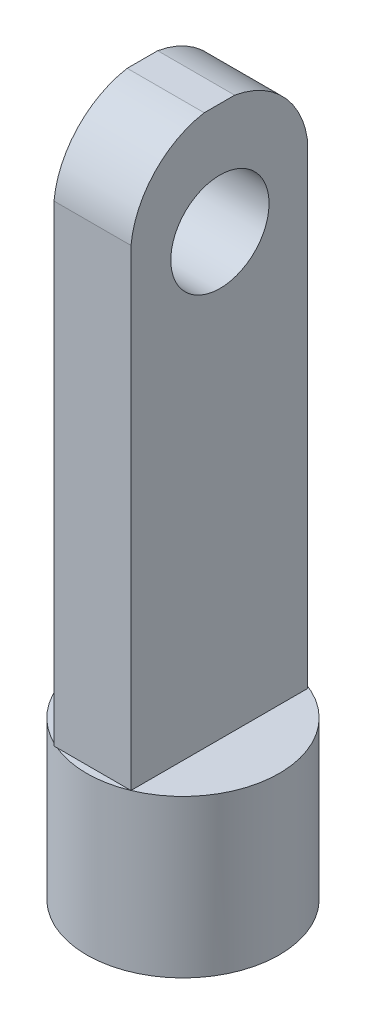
ISO-10303-21;
HEADER;
FILE_DESCRIPTION(('STEP AP214'),'2;1');
FILE_NAME('part.step','',(''),(''),'','','');
FILE_SCHEMA(('AUTOMOTIVE_DESIGN { 1 0 10303 214 1 1 1 1 }'));
ENDSEC;
DATA;
#1=APPLICATION_CONTEXT('core data for automotive mechanical design processes');
#2=APPLICATION_PROTOCOL_DEFINITION('international standard','automotive_design',2000,#1);
#3=PRODUCT_CONTEXT('',#1,'mechanical');
#4=PRODUCT('Part','Part','',(#3));
#5=PRODUCT_RELATED_PRODUCT_CATEGORY('part','',(#4));
#6=PRODUCT_DEFINITION_FORMATION('','',#4);
#7=PRODUCT_DEFINITION_CONTEXT('part definition',#1,'design');
#8=PRODUCT_DEFINITION('design','',#6,#7);
#9=PRODUCT_DEFINITION_SHAPE('','',#8);
#10=(LENGTH_UNIT() NAMED_UNIT(*) SI_UNIT(.MILLI.,.METRE.));
#11=(NAMED_UNIT(*) PLANE_ANGLE_UNIT() SI_UNIT($,.RADIAN.));
#12=(NAMED_UNIT(*) SI_UNIT($,.STERADIAN.) SOLID_ANGLE_UNIT());
#13=UNCERTAINTY_MEASURE_WITH_UNIT(LENGTH_MEASURE(1.E-05),#10,'distance_accuracy_value','');
#14=(GEOMETRIC_REPRESENTATION_CONTEXT(3) GLOBAL_UNCERTAINTY_ASSIGNED_CONTEXT((#13)) GLOBAL_UNIT_ASSIGNED_CONTEXT((#10,
#11,#12)) REPRESENTATION_CONTEXT('',''));
#15=CARTESIAN_POINT('',(0.,0.,0.));
#16=DIRECTION('',(0.,0.,1.));
#17=DIRECTION('',(1.,0.,0.));
#18=AXIS2_PLACEMENT_3D('',#15,#16,#17);
#19=CARTESIAN_POINT('',(-2.58914266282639,45.72,-5.65880457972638));
#20=DIRECTION('',(1.,0.,0.));
#21=DIRECTION('',(0.,0.,-1.));
#22=AXIS2_PLACEMENT_3D('',#19,#20,#21);
#23=PLANE('',#22);
#24=CARTESIAN_POINT('',(-2.58914266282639,40.0566654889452,0.0305906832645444));
#25=DIRECTION('',(-1.,0.,0.));
#26=DIRECTION('',(0.,0.,1.));
#27=AXIS2_PLACEMENT_3D('',#24,#25,#26);
#28=CIRCLE('',#27,5.74821450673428);
#29=CARTESIAN_POINT('',(-2.58914266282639,45.72,-0.953590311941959));
#30=VERTEX_POINT('',#29);
#31=CARTESIAN_POINT('',(-2.58914266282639,40.8768798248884,-5.65880457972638));
#32=VERTEX_POINT('',#31);
#33=EDGE_CURVE('E90',#30,#32,#28,.T.);
#34=ORIENTED_EDGE('',*,*,#33,.T.);
#35=DIRECTION('',(0.,-1.,0.));
#36=VECTOR('',#35,1.);
#37=CARTESIAN_POINT('',(-2.58914266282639,45.72,-5.65880457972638));
#38=LINE('',#37,#36);
#39=CARTESIAN_POINT('',(-2.58914266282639,10.16,-5.65880457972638));
#40=VERTEX_POINT('',#39);
#41=EDGE_CURVE('E112',#32,#40,#38,.T.);
#42=ORIENTED_EDGE('',*,*,#41,.T.);
#43=DIRECTION('',(0.,0.,1.));
#44=VECTOR('',#43,1.);
#45=CARTESIAN_POINT('',(-2.58914266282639,10.16,-5.65880457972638));
#46=LINE('',#45,#44);
#47=CARTESIAN_POINT('',(-2.58914266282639,10.16,5.65880457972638));
#48=VERTEX_POINT('',#47);
#49=EDGE_CURVE('E120',#40,#48,#46,.T.);
#50=ORIENTED_EDGE('',*,*,#49,.T.);
#51=CARTESIAN_POINT('',(-2.58914266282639,10.16,5.74708307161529));
#52=VERTEX_POINT('',#51);
#53=EDGE_CURVE('E124',#48,#52,#46,.T.);
#54=ORIENTED_EDGE('',*,*,#53,.T.);
#55=DIRECTION('',(0.,-1.,0.));
#56=VECTOR('',#55,1.);
#57=CARTESIAN_POINT('',(-2.58914266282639,45.72,5.74708307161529));
#58=LINE('',#57,#56);
#59=CARTESIAN_POINT('',(-2.58914266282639,40.6597283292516,5.74708307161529));
#60=VERTEX_POINT('',#59);
#61=EDGE_CURVE('E135',#60,#52,#58,.T.);
#62=ORIENTED_EDGE('',*,*,#61,.F.);
#63=CARTESIAN_POINT('',(-2.58914266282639,40.0566654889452,0.0305906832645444));
#64=DIRECTION('',(-1.,0.,0.));
#65=DIRECTION('',(0.,0.,1.));
#66=AXIS2_PLACEMENT_3D('',#63,#64,#65);
#67=CIRCLE('',#66,5.74821450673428);
#68=CARTESIAN_POINT('',(-2.58914266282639,45.72,1.01477167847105));
#69=VERTEX_POINT('',#68);
#70=EDGE_CURVE('E109',#60,#69,#67,.T.);
#71=ORIENTED_EDGE('',*,*,#70,.T.);
#72=DIRECTION('',(0.,0.,1.));
#73=VECTOR('',#72,1.);
#74=CARTESIAN_POINT('',(-2.58914266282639,45.72,-5.65880457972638));
#75=LINE('',#74,#73);
#76=EDGE_CURVE('E103',#30,#69,#75,.T.);
#77=ORIENTED_EDGE('',*,*,#76,.F.);
#78=EDGE_LOOP('',(#34,#42,#50,#54,#62,#71,#77));
#79=FACE_BOUND('',#78,.T.);
#80=CARTESIAN_POINT('',(-2.58914266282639,38.5531542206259,0.));
#81=DIRECTION('',(1.,0.,0.));
#82=DIRECTION('',(0.,0.,-1.));
#83=AXIS2_PLACEMENT_3D('',#80,#81,#82);
#84=CIRCLE('',#83,3.175);
#85=CARTESIAN_POINT('',(-2.58914266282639,38.5531542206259,-3.175));
#86=VERTEX_POINT('',#85);
#87=EDGE_CURVE('E36',#86,#86,#84,.F.);
#88=ORIENTED_EDGE('',*,*,#87,.F.);
#89=EDGE_LOOP('',(#88));
#90=FACE_BOUND('',#89,.T.);
#91=ADVANCED_FACE('F32',(#79,#90),#23,.F.);
#92=CARTESIAN_POINT('',(2.38678972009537,45.72,-5.65880457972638));
#93=DIRECTION('',(-1.,0.,0.));
#94=DIRECTION('',(0.,0.,1.));
#95=AXIS2_PLACEMENT_3D('',#92,#93,#94);
#96=PLANE('',#95);
#97=CARTESIAN_POINT('',(2.38678972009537,40.0566654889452,0.0305906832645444));
#98=DIRECTION('',(-1.,0.,0.));
#99=DIRECTION('',(0.,0.,1.));
#100=AXIS2_PLACEMENT_3D('',#97,#98,#99);
#101=CIRCLE('',#100,5.74821450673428);
#102=CARTESIAN_POINT('',(2.38678972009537,45.72,-0.953590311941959));
#103=VERTEX_POINT('',#102);
#104=CARTESIAN_POINT('',(2.38678972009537,40.8768798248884,-5.65880457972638));
#105=VERTEX_POINT('',#104);
#106=EDGE_CURVE('E47',#103,#105,#101,.T.);
#107=ORIENTED_EDGE('',*,*,#106,.F.);
#108=DIRECTION('',(0.,0.,-1.));
#109=VECTOR('',#108,1.);
#110=CARTESIAN_POINT('',(2.38678972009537,45.72,-5.65880457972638));
#111=LINE('',#110,#109);
#112=CARTESIAN_POINT('',(2.38678972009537,45.72,1.01477167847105));
#113=VERTEX_POINT('',#112);
#114=EDGE_CURVE('E105',#113,#103,#111,.T.);
#115=ORIENTED_EDGE('',*,*,#114,.F.);
#116=CARTESIAN_POINT('',(2.38678972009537,40.0566654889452,0.0305906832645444));
#117=DIRECTION('',(-1.,0.,0.));
#118=DIRECTION('',(0.,0.,1.));
#119=AXIS2_PLACEMENT_3D('',#116,#117,#118);
#120=CIRCLE('',#119,5.74821450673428);
#121=CARTESIAN_POINT('',(2.38678972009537,40.6597283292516,5.74708307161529));
#122=VERTEX_POINT('',#121);
#123=EDGE_CURVE('E55',#122,#113,#120,.T.);
#124=ORIENTED_EDGE('',*,*,#123,.F.);
#125=DIRECTION('',(0.,-1.,0.));
#126=VECTOR('',#125,1.);
#127=CARTESIAN_POINT('',(2.38678972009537,45.72,5.74708307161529));
#128=LINE('',#127,#126);
#129=CARTESIAN_POINT('',(2.38678972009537,10.16,5.74708307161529));
#130=VERTEX_POINT('',#129);
#131=EDGE_CURVE('E133',#122,#130,#128,.T.);
#132=ORIENTED_EDGE('',*,*,#131,.T.);
#133=DIRECTION('',(0.,0.,-1.));
#134=VECTOR('',#133,1.);
#135=CARTESIAN_POINT('',(2.38678972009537,10.16,-5.65880457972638));
#136=LINE('',#135,#134);
#137=CARTESIAN_POINT('',(2.38678972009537,10.16,-5.65880457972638));
#138=VERTEX_POINT('',#137);
#139=EDGE_CURVE('E115',#130,#138,#136,.T.);
#140=ORIENTED_EDGE('',*,*,#139,.T.);
#141=DIRECTION('',(0.,-1.,0.));
#142=VECTOR('',#141,1.);
#143=CARTESIAN_POINT('',(2.38678972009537,45.72,-5.65880457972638));
#144=LINE('',#143,#142);
#145=EDGE_CURVE('E131',#105,#138,#144,.T.);
#146=ORIENTED_EDGE('',*,*,#145,.F.);
#147=EDGE_LOOP('',(#107,#115,#124,#132,#140,#146));
#148=FACE_BOUND('',#147,.T.);
#149=CARTESIAN_POINT('',(2.38678972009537,38.5531542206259,0.));
#150=DIRECTION('',(1.,0.,0.));
#151=DIRECTION('',(0.,0.,-1.));
#152=AXIS2_PLACEMENT_3D('',#149,#150,#151);
#153=CIRCLE('',#152,3.175);
#154=CARTESIAN_POINT('',(2.38678972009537,38.5531542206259,-3.175));
#155=VERTEX_POINT('',#154);
#156=EDGE_CURVE('E97',#155,#155,#153,.T.);
#157=ORIENTED_EDGE('',*,*,#156,.F.);
#158=EDGE_LOOP('',(#157));
#159=FACE_BOUND('',#158,.T.);
#160=ADVANCED_FACE('F177',(#148,#159),#96,.F.);
#161=CARTESIAN_POINT('',(0.,45.72,0.));
#162=DIRECTION('',(0.,1.,0.));
#163=DIRECTION('',(0.,0.,1.));
#164=AXIS2_PLACEMENT_3D('',#161,#162,#163);
#165=PLANE('',#164);
#166=ORIENTED_EDGE('',*,*,#114,.T.);
#167=DIRECTION('',(-1.,0.,0.));
#168=VECTOR('',#167,1.);
#169=CARTESIAN_POINT('',(32.9708573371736,45.72,-0.953590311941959));
#170=LINE('',#169,#168);
#171=EDGE_CURVE('E93',#103,#30,#170,.T.);
#172=ORIENTED_EDGE('',*,*,#171,.T.);
#173=ORIENTED_EDGE('',*,*,#76,.T.);
#174=DIRECTION('',(-1.,0.,0.));
#175=VECTOR('',#174,1.);
#176=CARTESIAN_POINT('',(32.9708573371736,45.72,1.01477167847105));
#177=LINE('',#176,#175);
#178=EDGE_CURVE('E41',#69,#113,#177,.F.);
#179=ORIENTED_EDGE('',*,*,#178,.T.);
#180=EDGE_LOOP('',(#166,#172,#173,#179));
#181=FACE_BOUND('',#180,.T.);
#182=ADVANCED_FACE('F102',(#181),#165,.T.);
#183=CARTESIAN_POINT('',(-2.58914266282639,45.72,-5.65880457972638));
#184=DIRECTION('',(0.,0.,1.));
#185=DIRECTION('',(1.,0.,0.));
#186=AXIS2_PLACEMENT_3D('',#183,#184,#185);
#187=PLANE('',#186);
#188=DIRECTION('',(-1.,0.,0.));
#189=VECTOR('',#188,1.);
#190=CARTESIAN_POINT('',(32.9708573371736,40.8768798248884,-5.65880457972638));
#191=LINE('',#190,#189);
#192=EDGE_CURVE('E11',#105,#32,#191,.T.);
#193=ORIENTED_EDGE('',*,*,#192,.F.);
#194=ORIENTED_EDGE('',*,*,#145,.T.);
#195=DIRECTION('',(-1.,0.,0.));
#196=VECTOR('',#195,1.);
#197=CARTESIAN_POINT('',(-2.58914266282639,10.16,-5.65880457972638));
#198=LINE('',#197,#196);
#199=EDGE_CURVE('E110',#138,#40,#198,.T.);
#200=ORIENTED_EDGE('',*,*,#199,.T.);
#201=ORIENTED_EDGE('',*,*,#41,.F.);
#202=EDGE_LOOP('',(#193,#194,#200,#201));
#203=FACE_BOUND('',#202,.T.);
#204=ADVANCED_FACE('F174',(#203),#187,.F.);
#205=CARTESIAN_POINT('',(-2.58914266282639,45.72,5.74708307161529));
#206=DIRECTION('',(0.,0.,-1.));
#207=DIRECTION('',(-1.,0.,0.));
#208=AXIS2_PLACEMENT_3D('',#205,#206,#207);
#209=PLANE('',#208);
#210=DIRECTION('',(-1.,0.,0.));
#211=VECTOR('',#210,1.);
#212=CARTESIAN_POINT('',(32.9708573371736,40.6597283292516,5.74708307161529));
#213=LINE('',#212,#211);
#214=EDGE_CURVE('E179',#122,#60,#213,.T.);
#215=ORIENTED_EDGE('',*,*,#214,.T.);
#216=ORIENTED_EDGE('',*,*,#61,.T.);
#217=DIRECTION('',(1.,0.,0.));
#218=VECTOR('',#217,1.);
#219=CARTESIAN_POINT('',(-2.58914266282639,10.16,5.74708307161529));
#220=LINE('',#219,#218);
#221=CARTESIAN_POINT('',(-2.38678972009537,10.16,5.74708307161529));
#222=VERTEX_POINT('',#221);
#223=EDGE_CURVE('E123',#52,#222,#220,.T.);
#224=ORIENTED_EDGE('',*,*,#223,.T.);
#225=EDGE_CURVE('E127',#222,#130,#220,.T.);
#226=ORIENTED_EDGE('',*,*,#225,.T.);
#227=ORIENTED_EDGE('',*,*,#131,.F.);
#228=EDGE_LOOP('',(#215,#216,#224,#226,#227));
#229=FACE_BOUND('',#228,.T.);
#230=ADVANCED_FACE('F149',(#229),#209,.F.);
#231=CARTESIAN_POINT('',(0.,10.16,0.));
#232=DIRECTION('',(0.,1.,0.));
#233=DIRECTION('',(0.,0.,1.));
#234=AXIS2_PLACEMENT_3D('',#231,#232,#233);
#235=PLANE('',#234);
#236=ORIENTED_EDGE('',*,*,#49,.F.);
#237=CARTESIAN_POINT('',(0.,10.16,0.));
#238=DIRECTION('',(0.,1.,0.));
#239=DIRECTION('',(0.,0.,1.));
#240=AXIS2_PLACEMENT_3D('',#237,#238,#239);
#241=CIRCLE('',#240,6.223);
#242=EDGE_CURVE('E141',#40,#48,#241,.T.);
#243=ORIENTED_EDGE('',*,*,#242,.T.);
#244=EDGE_LOOP('',(#236,#243));
#245=FACE_BOUND('',#244,.T.);
#246=ADVANCED_FACE('F169',(#245),#235,.T.);
#247=ORIENTED_EDGE('',*,*,#199,.F.);
#248=ORIENTED_EDGE('',*,*,#139,.F.);
#249=EDGE_CURVE('E138',#130,#40,#241,.T.);
#250=ORIENTED_EDGE('',*,*,#249,.T.);
#251=EDGE_LOOP('',(#247,#248,#250));
#252=FACE_BOUND('',#251,.T.);
#253=ADVANCED_FACE('F172',(#252),#235,.T.);
#254=CARTESIAN_POINT('',(0.,10.16,0.));
#255=DIRECTION('',(0.,-1.,0.));
#256=DIRECTION('',(0.,0.,-1.));
#257=AXIS2_PLACEMENT_3D('',#254,#255,#256);
#258=CYLINDRICAL_SURFACE('',#257,6.223);
#259=ORIENTED_EDGE('',*,*,#249,.F.);
#260=EDGE_CURVE('E142',#222,#130,#241,.T.);
#261=ORIENTED_EDGE('',*,*,#260,.F.);
#262=EDGE_CURVE('E161',#48,#222,#241,.T.);
#263=ORIENTED_EDGE('',*,*,#262,.F.);
#264=ORIENTED_EDGE('',*,*,#242,.F.);
#265=EDGE_LOOP('',(#259,#261,#263,#264));
#266=FACE_BOUND('',#265,.T.);
#267=CARTESIAN_POINT('',(0.,0.,0.));
#268=DIRECTION('',(0.,1.,0.));
#269=DIRECTION('',(0.,0.,1.));
#270=AXIS2_PLACEMENT_3D('',#267,#268,#269);
#271=CIRCLE('',#270,6.223);
#272=CARTESIAN_POINT('',(0.,0.,6.223));
#273=VERTEX_POINT('',#272);
#274=EDGE_CURVE('E137',#273,#273,#271,.T.);
#275=ORIENTED_EDGE('',*,*,#274,.T.);
#276=EDGE_LOOP('',(#275));
#277=FACE_BOUND('',#276,.T.);
#278=ADVANCED_FACE('F34',(#266,#277),#258,.T.);
#279=ORIENTED_EDGE('',*,*,#225,.F.);
#280=ORIENTED_EDGE('',*,*,#260,.T.);
#281=EDGE_LOOP('',(#279,#280));
#282=FACE_BOUND('',#281,.T.);
#283=ADVANCED_FACE('F154',(#282),#235,.T.);
#284=CARTESIAN_POINT('',(0.,0.,0.));
#285=DIRECTION('',(0.,1.,0.));
#286=DIRECTION('',(0.,0.,1.));
#287=AXIS2_PLACEMENT_3D('',#284,#285,#286);
#288=PLANE('',#287);
#289=ORIENTED_EDGE('',*,*,#274,.F.);
#290=EDGE_LOOP('',(#289));
#291=FACE_BOUND('',#290,.T.);
#292=ADVANCED_FACE('F199',(#291),#288,.F.);
#293=CARTESIAN_POINT('',(0.,10.16,0.));
#294=DIRECTION('',(0.,1.,0.));
#295=DIRECTION('',(0.,0.,1.));
#296=AXIS2_PLACEMENT_3D('',#293,#294,#295);
#297=PLANE('',#296);
#298=ORIENTED_EDGE('',*,*,#53,.F.);
#299=ORIENTED_EDGE('',*,*,#262,.T.);
#300=ORIENTED_EDGE('',*,*,#223,.F.);
#301=EDGE_LOOP('',(#298,#299,#300));
#302=FACE_BOUND('',#301,.T.);
#303=ADVANCED_FACE('F165',(#302),#297,.F.);
#304=CARTESIAN_POINT('',(32.9708573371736,40.0566654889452,0.0305906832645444));
#305=DIRECTION('',(-1.,0.,0.));
#306=DIRECTION('',(0.,0.,1.));
#307=AXIS2_PLACEMENT_3D('',#304,#305,#306);
#308=CYLINDRICAL_SURFACE('',#307,5.74821450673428);
#309=ORIENTED_EDGE('',*,*,#123,.T.);
#310=ORIENTED_EDGE('',*,*,#178,.F.);
#311=ORIENTED_EDGE('',*,*,#70,.F.);
#312=ORIENTED_EDGE('',*,*,#214,.F.);
#313=EDGE_LOOP('',(#309,#310,#311,#312));
#314=FACE_BOUND('',#313,.T.);
#315=ADVANCED_FACE('F205',(#314),#308,.T.);
#316=CARTESIAN_POINT('',(32.9708573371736,40.0566654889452,0.0305906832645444));
#317=DIRECTION('',(-1.,0.,0.));
#318=DIRECTION('',(0.,0.,1.));
#319=AXIS2_PLACEMENT_3D('',#316,#317,#318);
#320=CYLINDRICAL_SURFACE('',#319,5.74821450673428);
#321=ORIENTED_EDGE('',*,*,#106,.T.);
#322=ORIENTED_EDGE('',*,*,#192,.T.);
#323=ORIENTED_EDGE('',*,*,#33,.F.);
#324=ORIENTED_EDGE('',*,*,#171,.F.);
#325=EDGE_LOOP('',(#321,#322,#323,#324));
#326=FACE_BOUND('',#325,.T.);
#327=ADVANCED_FACE('F92',(#326),#320,.T.);
#328=CARTESIAN_POINT('',(-2.69321027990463,38.5531542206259,0.));
#329=DIRECTION('',(1.,0.,0.));
#330=DIRECTION('',(0.,0.,-1.));
#331=AXIS2_PLACEMENT_3D('',#328,#329,#330);
#332=CYLINDRICAL_SURFACE('',#331,3.175);
#333=ORIENTED_EDGE('',*,*,#87,.T.);
#334=EDGE_LOOP('',(#333));
#335=FACE_BOUND('',#334,.T.);
#336=ORIENTED_EDGE('',*,*,#156,.T.);
#337=EDGE_LOOP('',(#336));
#338=FACE_BOUND('',#337,.T.);
#339=ADVANCED_FACE('F189',(#335,#338),#332,.F.);
#340=CLOSED_SHELL('',(#91,#160,#182,#204,#230,#246,#253,#278,#283,#292,#303,#315,#327,#339));
#341=MANIFOLD_SOLID_BREP('B2',#340);
#342=ADVANCED_BREP_SHAPE_REPRESENTATION('',(#18,#341),#14);
#343=SHAPE_DEFINITION_REPRESENTATION(#9,#342);
ENDSEC;
END-ISO-10303-21;
